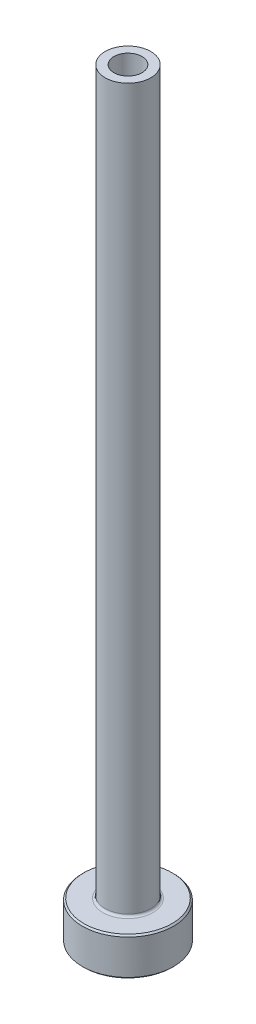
from build123d import *

# Parameters (mm, degrees)
FILLET1_R     = 0.3
CHAMFER1_SIZE = 0.2
CHAMFER3_SIZE = 0.5


with BuildPart() as part:
    # Sketch1 → Revolve1 (revolve)
    with BuildSketch(Plane.XY, mode=Mode.PRIVATE) as revolve1_sk:
        Polygon((-1.85, 100), (-3, 100), (-3, 5), (-6, 5), (-6, 0), (-2.1, 0), (-2.1, 43), (-1.85, 55), align=None)
    revolve(revolve1_sk.sketch.rotate(Axis((0, 92.187680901, 0), (0, -1, 0)), 270), axis=Axis((0, 92.187680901, 0), (0, -1, 0)))

    # Fillet1
    fillet1_edges = [part.edges().sort_by_distance(p)[0] for p in [
        (0, 5, -3),
    ]]
    fillet(fillet1_edges, radius=FILLET1_R)

    # Chamfer1
    chamfer1_edges = [part.edges().sort_by_distance(p)[0] for p in [
        (0, 0, -6),
        (0, 5, -6),
    ]]
    chamfer(chamfer1_edges, length=CHAMFER1_SIZE)

    # Chamfer3
    chamfer3_edges = [part.edges().sort_by_distance(p)[0] for p in [
        (0, 0, -2.1),
    ]]
    chamfer(chamfer3_edges, length=CHAMFER3_SIZE)


solid = part.part
